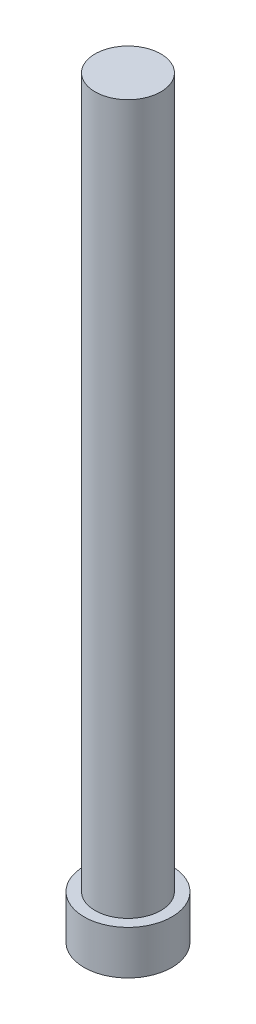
from build123d import *


with BuildPart() as part:
    # Esquisse1 → Base-R_volution (revolve)
    with BuildSketch(Plane.XY, mode=Mode.PRIVATE) as base_r_volution_sk:
        Polygon((0, 0), (-6, 0), (-6, 6), (-4.5, 6), (-4.5, 103), (0, 103), align=None)
    revolve(base_r_volution_sk.sketch.rotate(Axis((0, 49.432307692, 0), (0, -1, 0)), 270), axis=Axis((0, 49.432307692, 0), (0, -1, 0)))


solid = part.part
